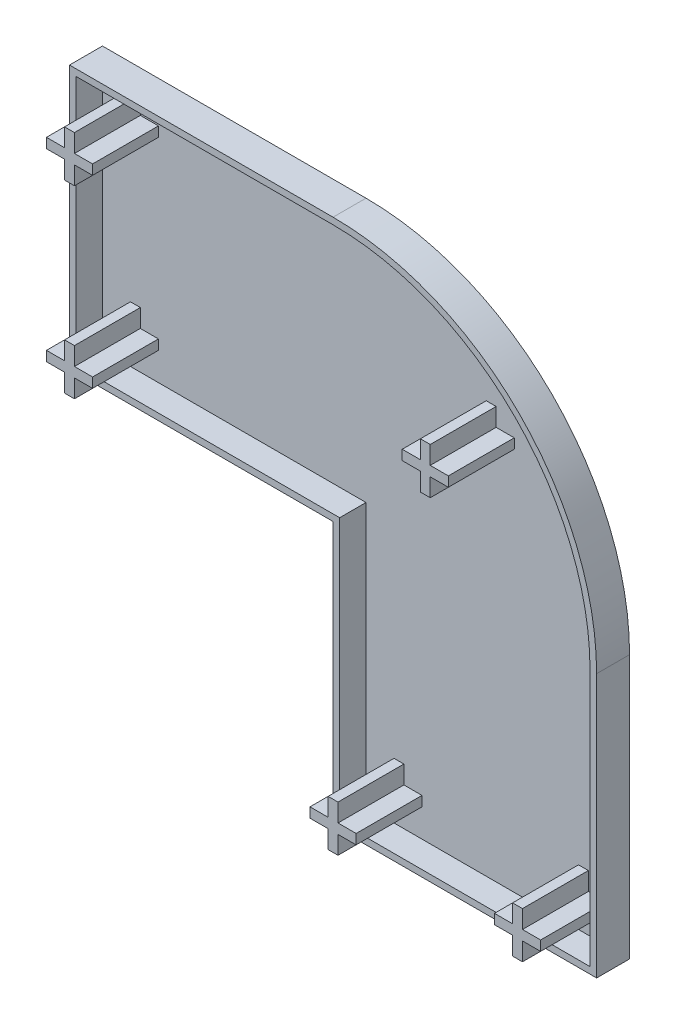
from build123d import *

# Parameters (mm, degrees)
EXTRUDE_1_DEPTH = 2.5
SHELL_1_T       = -1
EXTRUDE_2_DEPTH = 10


with BuildPart() as part:
    # Sketch 1 → Extrude 1 (new, symmetric)
    with BuildSketch(Plane.XY):
        with BuildLine():
            Line((-40, 40), (0, 40))
            ThreePointArc((0, 40), (28.284271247, 28.284271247), (40, 0))
            Line((40, 0), (40, -40))
            Line((40, -40), (0, -40))
            Line((0, -40), (0, 0))
            Line((0, 0), (-40, 0))
            Line((-40, 0), (-40, 40))
        make_face()
    extrude(amount=EXTRUDE_1_DEPTH, both=True)

    # Shell 1
    shell_1_openings = [part.faces().sort_by_distance(p)[0] for p in [
        (4.786867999, 4.786867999, 2.5),
    ]]
    offset(amount=SHELL_1_T, openings=shell_1_openings, kind=Kind.INTERSECTION)

    # Sketch 2 → Extrude 2 (add)
    with BuildSketch(Plane.XY.offset(-1.5)):
        Polygon((20.75, 19.25), (23.5, 19.25), (23.5, 20.75), (20.75, 20.75), (20.75, 23.5), (19.25, 23.5), (19.25, 20.75), (16.5, 20.75), (16.5, 19.25), (19.25, 19.25), (19.25, 16.5), (20.75, 16.5), align=None)
        Polygon((6.75, -34.75), (9.5, -34.75), (9.5, -33.25), (6.75, -33.25), (6.75, -30.5), (5.25, -30.5), (5.25, -33.25), (2.5, -33.25), (2.5, -34.75), (5.25, -34.75), (5.25, -37.5), (6.75, -37.5), align=None)
        Polygon((34.75, -34.75), (37.5, -34.75), (37.5, -33.25), (34.75, -33.25), (34.75, -30.5), (33.25, -30.5), (33.25, -33.25), (30.5, -33.25), (30.5, -34.75), (33.25, -34.75), (33.25, -37.5), (34.75, -37.5), align=None)
        Polygon((-34.75, 33.25), (-37.5, 33.25), (-37.5, 34.75), (-34.75, 34.75), (-34.75, 37.5), (-33.25, 37.5), (-33.25, 34.75), (-30.5, 34.75), (-30.5, 33.25), (-33.25, 33.25), (-33.25, 30.5), (-34.75, 30.5), align=None)
        Polygon((-34.75, 5.25), (-37.5, 5.25), (-37.5, 6.75), (-34.75, 6.75), (-34.75, 9.5), (-33.25, 9.5), (-33.25, 6.75), (-30.5, 6.75), (-30.5, 5.25), (-33.25, 5.25), (-33.25, 2.5), (-34.75, 2.5), align=None)
    extrude(amount=EXTRUDE_2_DEPTH)


solid = part.part
